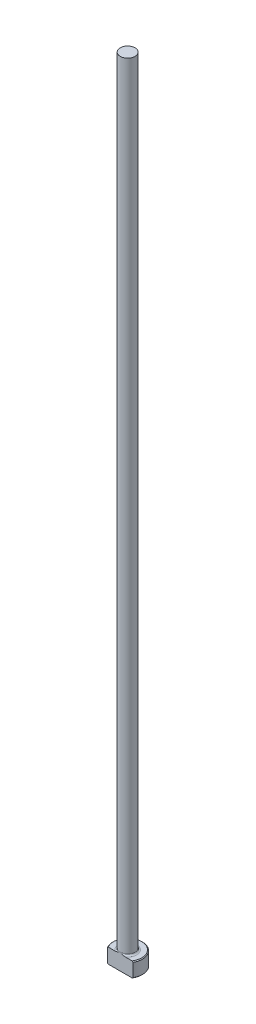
ISO-10303-21;
HEADER;
FILE_DESCRIPTION(('STEP AP214'),'2;1');
FILE_NAME('part.step','',(''),(''),'','','');
FILE_SCHEMA(('AUTOMOTIVE_DESIGN { 1 0 10303 214 1 1 1 1 }'));
ENDSEC;
DATA;
#1=APPLICATION_CONTEXT('core data for automotive mechanical design processes');
#2=APPLICATION_PROTOCOL_DEFINITION('international standard','automotive_design',2000,#1);
#3=PRODUCT_CONTEXT('',#1,'mechanical');
#4=PRODUCT('Part','Part','',(#3));
#5=PRODUCT_RELATED_PRODUCT_CATEGORY('part','',(#4));
#6=PRODUCT_DEFINITION_FORMATION('','',#4);
#7=PRODUCT_DEFINITION_CONTEXT('part definition',#1,'design');
#8=PRODUCT_DEFINITION('design','',#6,#7);
#9=PRODUCT_DEFINITION_SHAPE('','',#8);
#10=(LENGTH_UNIT() NAMED_UNIT(*) SI_UNIT(.MILLI.,.METRE.));
#11=(NAMED_UNIT(*) PLANE_ANGLE_UNIT() SI_UNIT($,.RADIAN.));
#12=(NAMED_UNIT(*) SI_UNIT($,.STERADIAN.) SOLID_ANGLE_UNIT());
#13=UNCERTAINTY_MEASURE_WITH_UNIT(LENGTH_MEASURE(1.E-05),#10,'distance_accuracy_value','');
#14=(GEOMETRIC_REPRESENTATION_CONTEXT(3) GLOBAL_UNCERTAINTY_ASSIGNED_CONTEXT((#13)) GLOBAL_UNIT_ASSIGNED_CONTEXT((#10,
#11,#12)) REPRESENTATION_CONTEXT('',''));
#15=CARTESIAN_POINT('',(0.,0.,0.));
#16=DIRECTION('',(0.,0.,1.));
#17=DIRECTION('',(1.,0.,0.));
#18=AXIS2_PLACEMENT_3D('',#15,#16,#17);
#19=CARTESIAN_POINT('',(0.,0.,0.));
#20=DIRECTION('',(0.,-1.,0.));
#21=DIRECTION('',(0.,0.,-1.));
#22=AXIS2_PLACEMENT_3D('',#19,#20,#21);
#23=PLANE('',#22);
#24=CARTESIAN_POINT('',(0.,0.,0.));
#25=DIRECTION('',(0.,-1.,0.));
#26=DIRECTION('',(0.,0.,-1.));
#27=AXIS2_PLACEMENT_3D('',#24,#25,#26);
#28=CIRCLE('',#27,4.5085);
#29=CARTESIAN_POINT('',(-3.82834437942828,0.,2.38124999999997));
#30=VERTEX_POINT('',#29);
#31=CARTESIAN_POINT('',(3.82834437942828,0.,2.38124999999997));
#32=VERTEX_POINT('',#31);
#33=EDGE_CURVE('E98',#30,#32,#28,.T.);
#34=ORIENTED_EDGE('',*,*,#33,.T.);
#35=DIRECTION('',(-1.,0.,0.));
#36=VECTOR('',#35,1.);
#37=CARTESIAN_POINT('',(-4.12444598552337,0.,2.38124999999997));
#38=LINE('',#37,#36);
#39=EDGE_CURVE('E83',#32,#30,#38,.T.);
#40=ORIENTED_EDGE('',*,*,#39,.T.);
#41=EDGE_LOOP('',(#34,#40));
#42=FACE_BOUND('',#41,.T.);
#43=ADVANCED_FACE('F32',(#42),#23,.T.);
#44=CARTESIAN_POINT('',(0.,259.958771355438,0.));
#45=DIRECTION('',(0.,1.,0.));
#46=DIRECTION('',(0.,0.,1.));
#47=AXIS2_PLACEMENT_3D('',#44,#45,#46);
#48=CYLINDRICAL_SURFACE('',#47,4.76249999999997);
#49=CARTESIAN_POINT('',(0.,4.49580000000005,0.));
#50=DIRECTION('',(0.,1.,0.));
#51=DIRECTION('',(0.,0.,1.));
#52=AXIS2_PLACEMENT_3D('',#49,#50,#51);
#53=CIRCLE('',#52,4.76249999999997);
#54=CARTESIAN_POINT('',(-4.12444598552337,4.49580000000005,2.38124999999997));
#55=VERTEX_POINT('',#54);
#56=CARTESIAN_POINT('',(4.12444598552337,4.49580000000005,2.38124999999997));
#57=VERTEX_POINT('',#56);
#58=EDGE_CURVE('E104',#55,#57,#53,.F.);
#59=ORIENTED_EDGE('',*,*,#58,.T.);
#60=DIRECTION('',(0.,-1.,0.));
#61=VECTOR('',#60,1.);
#62=CARTESIAN_POINT('',(4.12444598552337,254.,2.38124999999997));
#63=LINE('',#62,#61);
#64=CARTESIAN_POINT('',(4.12444598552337,0.254000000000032,2.38124999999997));
#65=VERTEX_POINT('',#64);
#66=EDGE_CURVE('E183',#57,#65,#63,.T.);
#67=ORIENTED_EDGE('',*,*,#66,.T.);
#68=CARTESIAN_POINT('',(0.,0.254000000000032,0.));
#69=DIRECTION('',(0.,-1.,0.));
#70=DIRECTION('',(0.,0.,-1.));
#71=AXIS2_PLACEMENT_3D('',#68,#69,#70);
#72=CIRCLE('',#71,4.76249999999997);
#73=CARTESIAN_POINT('',(-4.12444598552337,0.254000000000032,2.38124999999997));
#74=VERTEX_POINT('',#73);
#75=EDGE_CURVE('E100',#65,#74,#72,.F.);
#76=ORIENTED_EDGE('',*,*,#75,.T.);
#77=DIRECTION('',(0.,-1.,0.));
#78=VECTOR('',#77,1.);
#79=CARTESIAN_POINT('',(-4.12444598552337,254.,2.38124999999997));
#80=LINE('',#79,#78);
#81=EDGE_CURVE('E93',#55,#74,#80,.T.);
#82=ORIENTED_EDGE('',*,*,#81,.F.);
#83=EDGE_LOOP('',(#59,#67,#76,#82));
#84=FACE_BOUND('',#83,.T.);
#85=ADVANCED_FACE('F158',(#84),#48,.T.);
#86=CARTESIAN_POINT('',(-4.76249999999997,4.7498,0.));
#87=DIRECTION('',(0.,1.,0.));
#88=DIRECTION('',(0.,0.,1.));
#89=AXIS2_PLACEMENT_3D('',#86,#87,#88);
#90=PLANE('',#89);
#91=CARTESIAN_POINT('',(0.,4.7498,0.));
#92=DIRECTION('',(0.,1.,0.));
#93=DIRECTION('',(0.,0.,1.));
#94=AXIS2_PLACEMENT_3D('',#91,#92,#93);
#95=CIRCLE('',#94,4.50850000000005);
#96=CARTESIAN_POINT('',(3.82834437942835,4.7498,2.38124999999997));
#97=VERTEX_POINT('',#96);
#98=CARTESIAN_POINT('',(-3.82834437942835,4.7498,2.38124999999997));
#99=VERTEX_POINT('',#98);
#100=EDGE_CURVE('E178',#97,#99,#95,.T.);
#101=ORIENTED_EDGE('',*,*,#100,.T.);
#102=DIRECTION('',(1.,0.,0.));
#103=VECTOR('',#102,1.);
#104=CARTESIAN_POINT('',(-4.76249999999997,4.7498,2.38124999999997));
#105=LINE('',#104,#103);
#106=CARTESIAN_POINT('',(-1.63628053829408,4.74979999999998,2.38124999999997));
#107=VERTEX_POINT('',#106);
#108=EDGE_CURVE('E57',#99,#107,#105,.T.);
#109=ORIENTED_EDGE('',*,*,#108,.T.);
#110=CARTESIAN_POINT('',(0.,4.7498,0.));
#111=DIRECTION('',(0.,1.,0.));
#112=DIRECTION('',(0.,0.,1.));
#113=AXIS2_PLACEMENT_3D('',#110,#111,#112);
#114=CIRCLE('',#113,2.88924999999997);
#115=CARTESIAN_POINT('',(1.63628053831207,4.74979999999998,2.38124999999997));
#116=VERTEX_POINT('',#115);
#117=EDGE_CURVE('E107',#107,#116,#114,.F.);
#118=ORIENTED_EDGE('',*,*,#117,.T.);
#119=EDGE_CURVE('E136',#116,#97,#105,.T.);
#120=ORIENTED_EDGE('',*,*,#119,.T.);
#121=EDGE_LOOP('',(#101,#109,#118,#120));
#122=FACE_BOUND('',#121,.T.);
#123=ADVANCED_FACE('F147',(#122),#90,.T.);
#124=CARTESIAN_POINT('',(0.,4.74980000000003,0.));
#125=DIRECTION('',(0.,-1.,0.));
#126=DIRECTION('',(0.,0.,-1.));
#127=AXIS2_PLACEMENT_3D('',#124,#125,#126);
#128=CONICAL_SURFACE('',#127,4.50850000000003,0.78539816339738);
#129=ORIENTED_EDGE('',*,*,#58,.F.);
#130=CARTESIAN_POINT('',(-9.07632696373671,-0.125199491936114,2.38124999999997));
#131=CARTESIAN_POINT('',(-8.87065492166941,0.0737284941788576,2.38124999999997));
#132=CARTESIAN_POINT('',(-8.66477571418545,0.272443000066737,2.38124999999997));
#133=CARTESIAN_POINT('',(-8.25247975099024,0.669318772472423,2.38124999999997));
#134=CARTESIAN_POINT('',(-8.04606298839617,0.867480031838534,2.38124999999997));
#135=CARTESIAN_POINT('',(-7.63246818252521,1.26321914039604,2.38124999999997));
#136=CARTESIAN_POINT('',(-7.42528980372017,1.46079663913,2.38124999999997));
#137=CARTESIAN_POINT('',(-7.0101055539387,1.85507820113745,2.38124999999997));
#138=CARTESIAN_POINT('',(-6.80209968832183,2.05178227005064,2.38124999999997));
#139=CARTESIAN_POINT('',(-6.38915972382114,2.44017052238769,2.38124999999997));
#140=CARTESIAN_POINT('',(-6.18424651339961,2.63187689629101,2.38124999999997));
#141=CARTESIAN_POINT('',(-5.77308768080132,3.01385494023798,2.38124999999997));
#142=CARTESIAN_POINT('',(-5.56684206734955,3.20412661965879,2.38124999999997));
#143=CARTESIAN_POINT('',(-5.15261075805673,3.58267904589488,2.38124999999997));
#144=CARTESIAN_POINT('',(-4.94462544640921,3.77096021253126,2.38124999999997));
#145=CARTESIAN_POINT('',(-4.52621156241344,4.14478322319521,2.38124999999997));
#146=CARTESIAN_POINT('',(-4.31578308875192,4.33032517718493,2.38124999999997));
#147=CARTESIAN_POINT('',(-3.9732977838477,4.62653970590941,2.38124999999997));
#148=CARTESIAN_POINT('',(-3.84233368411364,4.73847402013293,2.38124999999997));
#149=CARTESIAN_POINT('',(-3.57870193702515,4.96034984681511,2.38124999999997));
#150=CARTESIAN_POINT('',(-3.44603412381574,5.07029116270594,2.38124999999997));
#151=CARTESIAN_POINT('',(-3.17710603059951,5.28865042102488,2.38124999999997));
#152=CARTESIAN_POINT('',(-3.04082260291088,5.39703998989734,2.38124999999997));
#153=CARTESIAN_POINT('',(-2.76536114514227,5.61002101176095,2.38124999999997));
#154=CARTESIAN_POINT('',(-2.62618382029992,5.71461337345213,2.38124999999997));
#155=CARTESIAN_POINT('',(-2.34176048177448,5.91999033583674,2.38124999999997));
#156=CARTESIAN_POINT('',(-2.19645440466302,6.02069298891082,2.38124999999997));
#157=CARTESIAN_POINT('',(-1.97428865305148,6.1655597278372,2.38124999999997));
#158=CARTESIAN_POINT('',(-1.89947233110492,6.21285188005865,2.38124999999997));
#159=CARTESIAN_POINT('',(-1.74824792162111,6.30480910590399,2.38124999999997));
#160=CARTESIAN_POINT('',(-1.67184001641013,6.34947447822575,2.38124999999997));
#161=CARTESIAN_POINT('',(-1.51812148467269,6.43500027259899,2.38124999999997));
#162=CARTESIAN_POINT('',(-1.44083334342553,6.47590056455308,2.38124999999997));
#163=CARTESIAN_POINT('',(-1.28426365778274,6.55366381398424,2.38124999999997));
#164=CARTESIAN_POINT('',(-1.20498175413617,6.5905260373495,2.38124999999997));
#165=CARTESIAN_POINT('',(-0.964237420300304,6.69331660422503,2.38124999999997));
#166=CARTESIAN_POINT('',(-0.799296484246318,6.75178843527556,2.38124999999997));
#167=CARTESIAN_POINT('',(-0.552002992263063,6.81508469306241,2.38124999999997));
#168=CARTESIAN_POINT('',(-0.472679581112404,6.83187402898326,2.38124999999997));
#169=CARTESIAN_POINT('',(-0.312773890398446,6.85789021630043,2.38124999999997));
#170=CARTESIAN_POINT('',(-0.232191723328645,6.86711773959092,2.38124999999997));
#171=CARTESIAN_POINT('',(-0.0707510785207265,6.87735689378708,2.38124999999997));
#172=CARTESIAN_POINT('',(0.0101057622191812,6.87839396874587,2.38124999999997));
#173=CARTESIAN_POINT('',(0.171507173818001,6.87224447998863,2.38124999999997));
#174=CARTESIAN_POINT('',(0.252051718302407,6.86505723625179,2.38124999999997));
#175=CARTESIAN_POINT('',(0.411371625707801,6.84305688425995,2.38124999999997));
#176=CARTESIAN_POINT('',(0.490156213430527,6.82830923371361,2.38124999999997));
#177=CARTESIAN_POINT('',(0.646152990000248,6.79210808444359,2.38124999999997));
#178=CARTESIAN_POINT('',(0.723364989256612,6.77065378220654,2.38124999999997));
#179=CARTESIAN_POINT('',(0.876400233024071,6.72193837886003,2.38124999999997));
#180=CARTESIAN_POINT('',(0.952212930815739,6.69464457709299,2.38124999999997));
#181=CARTESIAN_POINT('',(1.10193128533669,6.63534625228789,2.38124999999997));
#182=CARTESIAN_POINT('',(1.17583732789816,6.60334269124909,2.38124999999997));
#183=CARTESIAN_POINT('',(1.3955424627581,6.50131937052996,2.38124999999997));
#184=CARTESIAN_POINT('',(1.53864983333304,6.42551986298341,2.38124999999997));
#185=CARTESIAN_POINT('',(1.81913956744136,6.2638890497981,2.38124999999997));
#186=CARTESIAN_POINT('',(1.95651442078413,6.17804511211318,2.38124999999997));
#187=CARTESIAN_POINT('',(2.22733973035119,5.99930873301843,2.38124999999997));
#188=CARTESIAN_POINT('',(2.36077258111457,5.90638983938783,2.38124999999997));
#189=CARTESIAN_POINT('',(2.62416712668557,5.7159349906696,2.38124999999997));
#190=CARTESIAN_POINT('',(2.75413052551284,5.61840136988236,2.38124999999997));
#191=CARTESIAN_POINT('',(3.01316313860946,5.41868784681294,2.38124999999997));
#192=CARTESIAN_POINT('',(3.14219807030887,5.31646368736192,2.38124999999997));
#193=CARTESIAN_POINT('',(3.39823529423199,5.10948276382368,2.38124999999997));
#194=CARTESIAN_POINT('',(3.52523736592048,5.0047257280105,2.38124999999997));
#195=CARTESIAN_POINT('',(3.7773350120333,4.79356196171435,2.38124999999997));
#196=CARTESIAN_POINT('',(3.90243446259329,4.68715984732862,2.38124999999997));
#197=CARTESIAN_POINT('',(4.15136801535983,4.47288413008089,2.38124999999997));
#198=CARTESIAN_POINT('',(4.27520209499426,4.36501050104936,2.38124999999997));
#199=CARTESIAN_POINT('',(4.60321413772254,4.07656359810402,2.38124999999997));
#200=CARTESIAN_POINT('',(4.80650119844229,3.89497797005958,2.38124999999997));
#201=CARTESIAN_POINT('',(5.21107441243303,3.52958761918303,2.38124999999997));
#202=CARTESIAN_POINT('',(5.41236050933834,3.34578283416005,2.38124999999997));
#203=CARTESIAN_POINT('',(5.81363012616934,2.97638105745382,2.38124999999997));
#204=CARTESIAN_POINT('',(6.01361224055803,2.79078254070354,2.38124999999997));
#205=CARTESIAN_POINT('',(6.41244027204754,2.41836889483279,2.38124999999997));
#206=CARTESIAN_POINT('',(6.61128618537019,2.23155376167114,2.38124999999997));
#207=CARTESIAN_POINT('',(6.99993042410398,1.86469200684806,2.38124999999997));
#208=CARTESIAN_POINT('',(7.18976440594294,1.68468313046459,2.38124999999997));
#209=CARTESIAN_POINT('',(7.56878170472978,1.32398052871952,2.38124999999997));
#210=CARTESIAN_POINT('',(7.75796501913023,1.14328680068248,2.38124999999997));
#211=CARTESIAN_POINT('',(8.1355930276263,0.781550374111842,2.38124999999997));
#212=CARTESIAN_POINT('',(8.32403831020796,0.60050828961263,2.38124999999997));
#213=CARTESIAN_POINT('',(8.70048952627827,0.237970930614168,2.38124999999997));
#214=CARTESIAN_POINT('',(8.88849546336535,0.0564756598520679,2.38124999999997));
#215=CARTESIAN_POINT('',(9.0763269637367,-0.125199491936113,2.38124999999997));
#216=B_SPLINE_CURVE_WITH_KNOTS('',3,(#130,#131,#132,#133,#134,#135,#136,#137,#138,#139,#140,
#141,#142,#143,#144,#145,#146,#147,#148,#149,#150,#151,#152,#153,#154,#155,#156,#157,#158,#159,
#160,#161,#162,#163,#164,#165,#166,#167,#168,#169,#170,#171,#172,#173,#174,#175,#176,#177,#178,
#179,#180,#181,#182,#183,#184,#185,#186,#187,#188,#189,#190,#191,#192,#193,#194,#195,#196,#197,
#198,#199,#200,#201,#202,#203,#204,#205,#206,#207,#208,#209,#210,#211,#212,#213,#214,#215),
.UNSPECIFIED.,.F.,.F.,(4,2,2,2,2,2,2,2,2,2,2,2,2,2,2,2,2,2,2,2,2,2,2,2,2,2,2,2,2,2,2,2,2,2,2,2,
2,2,2,2,2,2,4),(0.,0.858406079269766,1.71682320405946,2.57567962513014,3.43453049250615,
4.27634907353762,5.11816214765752,5.95979398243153,6.80139193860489,7.31822134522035,
7.83510145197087,8.3574434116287,8.87965953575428,9.40980621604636,9.67529378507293,
9.94075110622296,10.2029603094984,10.4652171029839,10.98772376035,11.230668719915,
11.4735920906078,11.7157605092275,11.9579489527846,12.1980750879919,12.4382300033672,
12.6797667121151,12.9212541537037,13.4063695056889,13.8921016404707,14.3797486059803,
14.8671514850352,15.3609694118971,15.854840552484,16.3475141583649,16.8401965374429,
17.6579054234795,18.4756372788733,19.2941393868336,20.112644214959,20.8974741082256,
21.6823070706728,22.4662646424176,23.2502157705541),.UNSPECIFIED.);
#217=EDGE_CURVE('E135',#55,#99,#216,.T.);
#218=ORIENTED_EDGE('',*,*,#217,.T.);
#219=ORIENTED_EDGE('',*,*,#100,.F.);
#220=EDGE_CURVE('E127',#97,#57,#216,.T.);
#221=ORIENTED_EDGE('',*,*,#220,.T.);
#222=EDGE_LOOP('',(#129,#218,#219,#221));
#223=FACE_BOUND('',#222,.T.);
#224=ADVANCED_FACE('F143',(#223),#128,.T.);
#225=CARTESIAN_POINT('',(0.,0.254000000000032,0.));
#226=DIRECTION('',(0.,1.,0.));
#227=DIRECTION('',(0.,0.,1.));
#228=AXIS2_PLACEMENT_3D('',#225,#226,#227);
#229=CONICAL_SURFACE('',#228,4.76249999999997,0.785398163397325);
#230=ORIENTED_EDGE('',*,*,#75,.F.);
#231=CARTESIAN_POINT('',(9.07632696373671,4.8749994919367,2.38124999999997));
#232=CARTESIAN_POINT('',(8.87065492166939,4.67607150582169,2.38124999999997));
#233=CARTESIAN_POINT('',(8.66477571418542,4.47735699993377,2.38124999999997));
#234=CARTESIAN_POINT('',(8.25247975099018,4.08048122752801,2.38124999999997));
#235=CARTESIAN_POINT('',(8.04606298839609,3.88231996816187,2.38124999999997));
#236=CARTESIAN_POINT('',(7.6324681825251,3.48658085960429,2.38124999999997));
#237=CARTESIAN_POINT('',(7.42528980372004,3.28900336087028,2.38124999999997));
#238=CARTESIAN_POINT('',(7.01010555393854,2.89472179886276,2.38124999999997));
#239=CARTESIAN_POINT('',(6.80209968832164,2.69801772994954,2.38124999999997));
#240=CARTESIAN_POINT('',(6.38915972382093,2.30962947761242,2.38124999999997));
#241=CARTESIAN_POINT('',(6.18424651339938,2.11792310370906,2.38124999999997));
#242=CARTESIAN_POINT('',(5.77308768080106,1.73594505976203,2.38124999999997));
#243=CARTESIAN_POINT('',(5.56684206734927,1.54567338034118,2.38124999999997));
#244=CARTESIAN_POINT('',(5.15261075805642,1.16712095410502,2.38124999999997));
#245=CARTESIAN_POINT('',(4.94462544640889,0.978839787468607,2.38124999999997));
#246=CARTESIAN_POINT('',(4.52621156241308,0.605016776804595,2.38124999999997));
#247=CARTESIAN_POINT('',(4.31578308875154,0.419474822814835,2.38124999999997));
#248=CARTESIAN_POINT('',(3.97329778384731,0.123260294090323,2.38124999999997));
#249=CARTESIAN_POINT('',(3.84233368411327,0.0113259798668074,2.38124999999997));
#250=CARTESIAN_POINT('',(3.5787019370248,-0.210549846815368,2.38124999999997));
#251=CARTESIAN_POINT('',(3.4460341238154,-0.320491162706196,2.38124999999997));
#252=CARTESIAN_POINT('',(3.17710603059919,-0.538850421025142,2.38124999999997));
#253=CARTESIAN_POINT('',(3.04082260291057,-0.647239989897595,2.38124999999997));
#254=CARTESIAN_POINT('',(2.76536114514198,-0.860221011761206,2.38124999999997));
#255=CARTESIAN_POINT('',(2.62618382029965,-0.964813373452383,2.38124999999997));
#256=CARTESIAN_POINT('',(2.34176048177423,-1.17019033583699,2.38124999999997));
#257=CARTESIAN_POINT('',(2.19645440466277,-1.27089298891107,2.38124999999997));
#258=CARTESIAN_POINT('',(1.97428865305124,-1.41575972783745,2.38124999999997));
#259=CARTESIAN_POINT('',(1.89947233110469,-1.4630518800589,2.38124999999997));
#260=CARTESIAN_POINT('',(1.74824792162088,-1.55500910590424,2.38124999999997));
#261=CARTESIAN_POINT('',(1.67184001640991,-1.59967447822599,2.38124999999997));
#262=CARTESIAN_POINT('',(1.51812148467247,-1.68520027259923,2.38124999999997));
#263=CARTESIAN_POINT('',(1.44083334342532,-1.72610056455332,2.38124999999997));
#264=CARTESIAN_POINT('',(1.28426365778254,-1.80386381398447,2.38124999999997));
#265=CARTESIAN_POINT('',(1.20498175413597,-1.84072603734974,2.38124999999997));
#266=CARTESIAN_POINT('',(0.964237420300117,-1.94351660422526,2.38124999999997));
#267=CARTESIAN_POINT('',(0.799296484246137,-2.00198843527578,2.38124999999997));
#268=CARTESIAN_POINT('',(0.552002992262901,-2.06528469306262,2.38124999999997));
#269=CARTESIAN_POINT('',(0.472679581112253,-2.08207402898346,2.38124999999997));
#270=CARTESIAN_POINT('',(0.312773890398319,-2.10809021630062,2.38124999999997));
#271=CARTESIAN_POINT('',(0.23219172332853,-2.11731773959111,2.38124999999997));
#272=CARTESIAN_POINT('',(0.0707510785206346,-2.12755689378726,2.38124999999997));
#273=CARTESIAN_POINT('',(-0.0101057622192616,-2.12859396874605,2.38124999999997));
#274=CARTESIAN_POINT('',(-0.171507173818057,-2.12244447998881,2.38124999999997));
#275=CARTESIAN_POINT('',(-0.25205171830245,-2.11525723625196,2.38124999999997));
#276=CARTESIAN_POINT('',(-0.411371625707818,-2.09325688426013,2.38124999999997));
#277=CARTESIAN_POINT('',(-0.490156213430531,-2.07850923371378,2.38124999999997));
#278=CARTESIAN_POINT('',(-0.646152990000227,-2.04230808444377,2.38124999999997));
#279=CARTESIAN_POINT('',(-0.723364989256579,-2.02085378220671,2.38124999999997));
#280=CARTESIAN_POINT('',(-0.876400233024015,-1.97213837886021,2.38124999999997));
#281=CARTESIAN_POINT('',(-0.95221293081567,-1.94484457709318,2.38124999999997));
#282=CARTESIAN_POINT('',(-1.1019312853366,-1.88554625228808,2.38124999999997));
#283=CARTESIAN_POINT('',(-1.17583732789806,-1.85354269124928,2.38124999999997));
#284=CARTESIAN_POINT('',(-1.39554246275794,-1.75151937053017,2.38124999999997));
#285=CARTESIAN_POINT('',(-1.53864983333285,-1.67571986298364,2.38124999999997));
#286=CARTESIAN_POINT('',(-1.8191395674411,-1.51408904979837,2.38124999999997));
#287=CARTESIAN_POINT('',(-1.95651442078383,-1.42824511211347,2.38124999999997));
#288=CARTESIAN_POINT('',(-2.22733973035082,-1.24950873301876,2.38124999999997));
#289=CARTESIAN_POINT('',(-2.36077258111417,-1.15658983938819,2.38124999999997));
#290=CARTESIAN_POINT('',(-2.62416712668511,-0.966134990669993,2.38124999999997));
#291=CARTESIAN_POINT('',(-2.75413052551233,-0.868601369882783,2.38124999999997));
#292=CARTESIAN_POINT('',(-3.01316313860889,-0.668887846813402,2.38124999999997));
#293=CARTESIAN_POINT('',(-3.14219807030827,-0.566663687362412,2.38124999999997));
#294=CARTESIAN_POINT('',(-3.39823529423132,-0.359682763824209,2.38124999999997));
#295=CARTESIAN_POINT('',(-3.52523736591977,-0.254925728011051,2.38124999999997));
#296=CARTESIAN_POINT('',(-3.77733501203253,-0.043761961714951,2.38124999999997));
#297=CARTESIAN_POINT('',(-3.90243446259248,0.0626401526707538,2.38124999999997));
#298=CARTESIAN_POINT('',(-4.15136801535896,0.276915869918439,2.38124999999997));
#299=CARTESIAN_POINT('',(-4.27520209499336,0.384789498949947,2.38124999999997));
#300=CARTESIAN_POINT('',(-4.60321413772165,0.673236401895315,2.38124999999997));
#301=CARTESIAN_POINT('',(-4.80650119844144,0.854822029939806,2.38124999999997));
#302=CARTESIAN_POINT('',(-5.21107441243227,1.22021238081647,2.38124999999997));
#303=CARTESIAN_POINT('',(-5.41236050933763,1.40401716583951,2.38124999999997));
#304=CARTESIAN_POINT('',(-5.81363012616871,1.77341894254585,2.38124999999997));
#305=CARTESIAN_POINT('',(-6.01361224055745,1.95901745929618,2.38124999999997));
#306=CARTESIAN_POINT('',(-6.41244027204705,2.33143110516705,2.38124999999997));
#307=CARTESIAN_POINT('',(-6.61128618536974,2.51824623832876,2.38124999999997));
#308=CARTESIAN_POINT('',(-6.9999304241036,2.88510799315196,2.38124999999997));
#309=CARTESIAN_POINT('',(-7.1897644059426,3.06511686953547,2.38124999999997));
#310=CARTESIAN_POINT('',(-7.56878170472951,3.42581947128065,2.38124999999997));
#311=CARTESIAN_POINT('',(-7.75796501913,3.60651319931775,2.38124999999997));
#312=CARTESIAN_POINT('',(-8.13559302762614,3.96824962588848,2.38124999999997));
#313=CARTESIAN_POINT('',(-8.32403831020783,4.14929171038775,2.38124999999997));
#314=CARTESIAN_POINT('',(-8.70048952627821,4.51182906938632,2.38124999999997));
#315=CARTESIAN_POINT('',(-8.88849546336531,4.69332434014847,2.38124999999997));
#316=CARTESIAN_POINT('',(-9.07632696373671,4.8749994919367,2.38124999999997));
#317=B_SPLINE_CURVE_WITH_KNOTS('',3,(#231,#232,#233,#234,#235,#236,#237,#238,#239,#240,#241,
#242,#243,#244,#245,#246,#247,#248,#249,#250,#251,#252,#253,#254,#255,#256,#257,#258,#259,#260,
#261,#262,#263,#264,#265,#266,#267,#268,#269,#270,#271,#272,#273,#274,#275,#276,#277,#278,#279,
#280,#281,#282,#283,#284,#285,#286,#287,#288,#289,#290,#291,#292,#293,#294,#295,#296,#297,#298,
#299,#300,#301,#302,#303,#304,#305,#306,#307,#308,#309,#310,#311,#312,#313,#314,#315,#316),
.UNSPECIFIED.,.F.,.F.,(4,2,2,2,2,2,2,2,2,2,2,2,2,2,2,2,2,2,2,2,2,2,2,2,2,2,2,2,2,2,2,2,2,2,2,2,
2,2,2,2,2,2,4),(0.,0.858406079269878,1.71682320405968,2.57567962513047,3.43453049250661,
4.27634907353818,5.11816214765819,5.95979398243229,6.80139193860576,7.31822134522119,
7.83510145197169,8.35744341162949,8.87965953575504,9.4098062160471,9.67529378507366,
9.94075110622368,10.2029603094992,10.4652171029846,10.9877237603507,11.2306687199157,
11.4735920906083,11.7157605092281,11.9579489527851,12.1980750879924,12.4382300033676,
12.6797667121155,12.9212541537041,13.4063695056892,13.8921016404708,14.3797486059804,
14.8671514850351,15.3609694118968,15.8548405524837,16.3475141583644,16.8401965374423,
17.6579054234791,18.4756372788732,19.2941393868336,20.1126442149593,20.897474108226,
21.6823070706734,22.4662646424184,23.2502157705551),.UNSPECIFIED.);
#318=EDGE_CURVE('E86',#65,#32,#317,.T.);
#319=ORIENTED_EDGE('',*,*,#318,.T.);
#320=ORIENTED_EDGE('',*,*,#33,.F.);
#321=EDGE_CURVE('E89',#30,#74,#317,.T.);
#322=ORIENTED_EDGE('',*,*,#321,.T.);
#323=EDGE_LOOP('',(#230,#319,#320,#322));
#324=FACE_BOUND('',#323,.T.);
#325=ADVANCED_FACE('F97',(#324),#229,.T.);
#326=CARTESIAN_POINT('',(0.,5.25779999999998,0.));
#327=DIRECTION('',(0.,1.,0.));
#328=DIRECTION('',(0.,0.,1.));
#329=AXIS2_PLACEMENT_3D('',#326,#327,#328);
#330=TOROIDAL_SURFACE('',#329,2.88924999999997,0.508);
#331=CARTESIAN_POINT('',(0.,5.25779999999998,2.38124999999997));
#332=CARTESIAN_POINT('',(0.,5.25780082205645,2.38124999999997));
#333=CARTESIAN_POINT('',(1.4424632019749E-07,5.25780164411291,2.38124999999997));
#334=CARTESIAN_POINT('',(6.16936516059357E-07,5.25780323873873,2.38124999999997));
#335=CARTESIAN_POINT('',(9.4858632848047E-07,5.25780401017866,2.38124999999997));
#336=CARTESIAN_POINT('',(1.75082081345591E-06,5.25780554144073,2.38124999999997));
#337=CARTESIAN_POINT('',(2.22915460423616E-06,5.25780629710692,2.38124999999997));
#338=CARTESIAN_POINT('',(3.27181463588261E-06,5.25780773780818,2.38124999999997));
#339=CARTESIAN_POINT('',(3.83567673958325E-06,5.25780842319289,2.38124999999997));
#340=CARTESIAN_POINT('',(5.8221973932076E-06,5.25781066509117,2.38124999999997));
#341=CARTESIAN_POINT('',(7.35849860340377E-06,5.25781212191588,2.38124999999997));
#342=CARTESIAN_POINT('',(1.05702999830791E-05,5.25781476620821,2.38124999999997));
#343=CARTESIAN_POINT('',(1.22411085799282E-05,5.25781595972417,2.38124999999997));
#344=CARTESIAN_POINT('',(1.86111250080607E-05,5.25782030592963,2.38124999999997));
#345=CARTESIAN_POINT('',(2.34784764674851E-05,5.25782322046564,2.38124999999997));
#346=CARTESIAN_POINT('',(3.31956639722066E-05,5.25782811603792,2.38124999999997));
#347=CARTESIAN_POINT('',(3.80196289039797E-05,5.25783015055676,2.38124999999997));
#348=CARTESIAN_POINT('',(5.81326131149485E-05,5.25783854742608,2.38124999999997));
#349=CARTESIAN_POINT('',(7.34799239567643E-05,5.25784474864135,2.38124999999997));
#350=CARTESIAN_POINT('',(0.000102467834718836,5.25785494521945,2.38124999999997));
#351=CARTESIAN_POINT('',(0.000116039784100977,5.25785912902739,2.38124999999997));
#352=CARTESIAN_POINT('',(0.000212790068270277,5.2578915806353,2.38124999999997));
#353=CARTESIAN_POINT('',(0.000291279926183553,5.25793204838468,2.38124999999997));
#354=CARTESIAN_POINT('',(0.000593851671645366,5.25808218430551,2.38124999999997));
#355=CARTESIAN_POINT('',(0.000821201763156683,5.25818279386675,2.38124999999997));
#356=CARTESIAN_POINT('',(0.00169456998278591,5.25857522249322,2.38124999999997));
#357=CARTESIAN_POINT('',(0.00233722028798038,5.25887652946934,2.38124999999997));
#358=CARTESIAN_POINT('',(0.00493753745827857,5.26008964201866,2.38124999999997));
#359=CARTESIAN_POINT('',(0.00689891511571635,5.26099082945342,2.38124999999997));
#360=CARTESIAN_POINT('',(0.0508383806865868,5.28118708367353,2.38124999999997));
#361=CARTESIAN_POINT('',(0.0927708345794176,5.30061501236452,2.38124999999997));
#362=CARTESIAN_POINT('',(0.175274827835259,5.33851044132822,2.38124999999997));
#363=CARTESIAN_POINT('',(0.215842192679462,5.35698764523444,2.38124999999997));
#364=CARTESIAN_POINT('',(0.30166577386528,5.39563561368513,2.38124999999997));
#365=CARTESIAN_POINT('',(0.346940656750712,5.41576561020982,2.38124999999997));
#366=CARTESIAN_POINT('',(0.438241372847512,5.45551278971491,2.38124999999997));
#367=CARTESIAN_POINT('',(0.48427022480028,5.47512306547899,2.38124999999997));
#368=CARTESIAN_POINT('',(0.565317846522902,5.50863652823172,2.38124999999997));
#369=CARTESIAN_POINT('',(0.600248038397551,5.52275299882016,2.38124999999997));
#370=CARTESIAN_POINT('',(0.67029539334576,5.55026700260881,2.38124999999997));
#371=CARTESIAN_POINT('',(0.705411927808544,5.56366614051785,2.38124999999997));
#372=CARTESIAN_POINT('',(0.809765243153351,5.60210810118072,2.38124999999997));
#373=CARTESIAN_POINT('',(0.879437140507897,5.62599843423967,2.38124999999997));
#374=CARTESIAN_POINT('',(0.996836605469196,5.66231043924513,2.38124999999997));
#375=CARTESIAN_POINT('',(1.04419582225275,5.67591104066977,2.38124999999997));
#376=CARTESIAN_POINT('',(1.13975994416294,5.70085221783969,2.38124999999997));
#377=CARTESIAN_POINT('',(1.18796799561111,5.71218047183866,2.38124999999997));
#378=CARTESIAN_POINT('',(1.33841293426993,5.74296860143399,2.38124999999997));
#379=CARTESIAN_POINT('',(1.44177435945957,5.7576740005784,2.38124999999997));
#380=CARTESIAN_POINT('',(1.6093691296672,5.76674980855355,2.38124999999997));
#381=CARTESIAN_POINT('',(1.67328580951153,5.76678281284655,2.38124999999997));
#382=CARTESIAN_POINT('',(1.79988036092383,5.75818170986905,2.38124999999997));
#383=CARTESIAN_POINT('',(1.86256375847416,5.74965525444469,2.38124999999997));
#384=CARTESIAN_POINT('',(1.96631053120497,5.72616398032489,2.38124999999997));
#385=CARTESIAN_POINT('',(2.00801024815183,5.71404279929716,2.38124999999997));
#386=CARTESIAN_POINT('',(2.0892985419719,5.68375726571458,2.38124999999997));
#387=CARTESIAN_POINT('',(2.12888534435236,5.66558792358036,2.38124999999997));
#388=CARTESIAN_POINT('',(2.19343451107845,5.6284571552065,2.38124999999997));
#389=CARTESIAN_POINT('',(2.21936120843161,5.61118061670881,2.38124999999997));
#390=CARTESIAN_POINT('',(2.26821976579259,5.57281353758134,2.38124999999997));
#391=CARTESIAN_POINT('',(2.29115716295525,5.55173022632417,2.38124999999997));
#392=CARTESIAN_POINT('',(2.32833519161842,5.51065246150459,2.38124999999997));
#393=CARTESIAN_POINT('',(2.34338589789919,5.4913946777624,2.38124999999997));
#394=CARTESIAN_POINT('',(2.37015797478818,5.45066634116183,2.38124999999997));
#395=CARTESIAN_POINT('',(2.38188059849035,5.42919662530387,2.38124999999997));
#396=CARTESIAN_POINT('',(2.40133155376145,5.38427591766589,2.38124999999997));
#397=CARTESIAN_POINT('',(2.40902526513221,5.36080970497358,2.38124999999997));
#398=CARTESIAN_POINT('',(2.41963338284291,5.31282025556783,2.38124999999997));
#399=CARTESIAN_POINT('',(2.42255209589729,5.28829799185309,2.38124999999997));
#400=CARTESIAN_POINT('',(2.42330579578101,5.24257134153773,2.38124999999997));
#401=CARTESIAN_POINT('',(2.42178572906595,5.22137526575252,2.38124999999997));
#402=CARTESIAN_POINT('',(2.41512107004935,5.17956667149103,2.38124999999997));
#403=CARTESIAN_POINT('',(2.40997679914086,5.15895410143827,2.38124999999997));
#404=CARTESIAN_POINT('',(2.39653123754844,5.11927433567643,2.38124999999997));
#405=CARTESIAN_POINT('',(2.38829719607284,5.10018404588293,2.38124999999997));
#406=CARTESIAN_POINT('',(2.36909923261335,5.06344104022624,2.38124999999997));
#407=CARTESIAN_POINT('',(2.35813436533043,5.04578882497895,2.38124999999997));
#408=CARTESIAN_POINT('',(2.32900707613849,5.00527867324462,2.38124999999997));
#409=CARTESIAN_POINT('',(2.3097304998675,4.98322039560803,2.38124999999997));
#410=CARTESIAN_POINT('',(2.26785259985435,4.94251014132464,2.38124999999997));
#411=CARTESIAN_POINT('',(2.24524341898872,4.92386645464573,2.38124999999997));
#412=CARTESIAN_POINT('',(2.18797490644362,4.88297636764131,2.38124999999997));
#413=CARTESIAN_POINT('',(2.1521587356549,4.86235631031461,2.38124999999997));
#414=CARTESIAN_POINT('',(2.07784819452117,4.8270360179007,2.38124999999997));
#415=CARTESIAN_POINT('',(2.03935503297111,4.81233313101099,2.38124999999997));
#416=CARTESIAN_POINT('',(1.93917045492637,4.78128020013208,2.38124999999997));
#417=CARTESIAN_POINT('',(1.87638619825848,4.76848853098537,2.38124999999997));
#418=CARTESIAN_POINT('',(1.74894813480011,4.75239141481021,2.38124999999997));
#419=CARTESIAN_POINT('',(1.68428057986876,4.74921386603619,2.38124999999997));
#420=CARTESIAN_POINT('',(1.56080715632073,4.75049930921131,2.38124999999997));
#421=CARTESIAN_POINT('',(1.50198901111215,4.75431101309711,2.38124999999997));
#422=CARTESIAN_POINT('',(1.38480921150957,4.76709949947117,2.38124999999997));
#423=CARTESIAN_POINT('',(1.32644892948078,4.77608822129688,2.38124999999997));
#424=CARTESIAN_POINT('',(1.21350353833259,4.79766265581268,2.38124999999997));
#425=CARTESIAN_POINT('',(1.15887777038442,4.81004137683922,2.38124999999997));
#426=CARTESIAN_POINT('',(1.05073291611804,4.83776073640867,2.38124999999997));
#427=CARTESIAN_POINT('',(0.997209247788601,4.85308377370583,2.38124999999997));
#428=CARTESIAN_POINT('',(0.874272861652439,4.89132980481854,2.38124999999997));
#429=CARTESIAN_POINT('',(0.805134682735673,4.91512993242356,2.38124999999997));
#430=CARTESIAN_POINT('',(0.701560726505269,4.95339027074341,2.38124999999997));
#431=CARTESIAN_POINT('',(0.666697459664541,4.96672252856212,2.38124999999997));
#432=CARTESIAN_POINT('',(0.59715245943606,4.99408908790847,2.38124999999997));
#433=CARTESIAN_POINT('',(0.562471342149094,5.00812495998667,2.38124999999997));
#434=CARTESIAN_POINT('',(0.481905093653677,5.04147709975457,2.38124999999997));
#435=CARTESIAN_POINT('',(0.436107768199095,5.06100454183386,2.38124999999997));
#436=CARTESIAN_POINT('',(0.345263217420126,5.10057637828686,2.38124999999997));
#437=CARTESIAN_POINT('',(0.300213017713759,5.12061397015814,2.38124999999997));
#438=CARTESIAN_POINT('',(0.214815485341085,5.15907936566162,2.38124999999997));
#439=CARTESIAN_POINT('',(0.174449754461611,5.17746700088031,2.38124999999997));
#440=CARTESIAN_POINT('',(0.0923551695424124,5.21517676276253,2.38124999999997));
#441=CARTESIAN_POINT('',(0.0506304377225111,5.23450847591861,2.38124999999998));
#442=CARTESIAN_POINT('',(0.00689891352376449,5.25460917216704,2.38124999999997));
#443=CARTESIAN_POINT('',(0.00493753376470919,5.25551035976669,2.38124999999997));
#444=CARTESIAN_POINT('',(0.00233721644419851,5.25672347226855,2.38124999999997));
#445=CARTESIAN_POINT('',(0.00169456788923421,5.25702477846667,2.38124999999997));
#446=CARTESIAN_POINT('',(0.000821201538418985,5.25741720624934,2.38124999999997));
#447=CARTESIAN_POINT('',(0.000593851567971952,5.25751781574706,2.38124999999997));
#448=CARTESIAN_POINT('',(0.000291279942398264,5.25766795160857,2.38124999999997));
#449=CARTESIAN_POINT('',(0.000212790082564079,5.25770841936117,2.38124999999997));
#450=CARTESIAN_POINT('',(0.000116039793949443,5.25774087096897,2.38124999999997));
#451=CARTESIAN_POINT('',(0.000102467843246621,5.25774505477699,2.38124999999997));
#452=CARTESIAN_POINT('',(7.34799295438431E-05,5.25775525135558,2.38124999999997));
#453=CARTESIAN_POINT('',(5.81326171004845E-05,5.25776145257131,2.38124999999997));
#454=CARTESIAN_POINT('',(3.80196309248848E-05,5.25776984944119,2.38124999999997));
#455=CARTESIAN_POINT('',(3.31956656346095E-05,5.25777188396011,2.38124999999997));
#456=CARTESIAN_POINT('',(2.34784774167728E-05,5.2577767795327,2.38124999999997));
#457=CARTESIAN_POINT('',(1.86111256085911E-05,5.25777969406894,2.38124999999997));
#458=CARTESIAN_POINT('',(1.22411087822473E-05,5.25778404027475,2.38124999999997));
#459=CARTESIAN_POINT('',(1.05703001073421E-05,5.25778523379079,2.38124999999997));
#460=CARTESIAN_POINT('',(7.3584985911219E-06,5.25778787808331,2.38124999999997));
#461=CARTESIAN_POINT('',(5.82219732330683E-06,5.25778933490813,2.38124999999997));
#462=CARTESIAN_POINT('',(3.83567661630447E-06,5.25779157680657,2.38124999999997));
#463=CARTESIAN_POINT('',(3.27181450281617E-06,5.25779226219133,2.38124999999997));
#464=CARTESIAN_POINT('',(2.22915446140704E-06,5.25779370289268,2.38124999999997));
#465=CARTESIAN_POINT('',(1.75082067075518E-06,5.25779445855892,2.38124999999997));
#466=CARTESIAN_POINT('',(9.48586199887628E-07,5.25779598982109,2.38124999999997));
#467=CARTESIAN_POINT('',(6.16936400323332E-07,5.25779676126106,2.38124999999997));
#468=CARTESIAN_POINT('',(1.44246247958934E-07,5.25779835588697,2.38124999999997));
#469=CARTESIAN_POINT('',(0.,5.25779917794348,2.38124999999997));
#470=CARTESIAN_POINT('',(0.,5.25779999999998,2.38124999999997));
#471=B_SPLINE_CURVE_WITH_KNOTS('',3,(#331,#332,#333,#334,#335,#336,#337,#338,#339,#340,#341,
#342,#343,#344,#345,#346,#347,#348,#349,#350,#351,#352,#353,#354,#355,#356,#357,#358,#359,#360,
#361,#362,#363,#364,#365,#366,#367,#368,#369,#370,#371,#372,#373,#374,#375,#376,#377,#378,#379,
#380,#381,#382,#383,#384,#385,#386,#387,#388,#389,#390,#391,#392,#393,#394,#395,#396,#397,#398,
#399,#400,#401,#402,#403,#404,#405,#406,#407,#408,#409,#410,#411,#412,#413,#414,#415,#416,#417,
#418,#419,#420,#421,#422,#423,#424,#425,#426,#427,#428,#429,#430,#431,#432,#433,#434,#435,#436,
#437,#438,#439,#440,#441,#442,#443,#444,#445,#446,#447,#448,#449,#450,#451,#452,#453,#454,#455,
#456,#457,#458,#459,#460,#461,#462,#463,#464,#465,#466,#467,#468,#469,#470),.UNSPECIFIED.,.T.,
.F.,(4,2,2,2,2,2,2,2,2,2,2,2,2,2,2,2,2,2,2,2,2,2,2,2,2,2,2,2,2,2,2,2,2,2,2,2,2,2,2,2,2,2,2,2,2,
2,2,2,2,2,2,2,2,2,2,2,2,2,2,2,2,2,2,2,2,2,2,2,2,4),(0.,2.46370354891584E-06,4.9708882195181E-06,
7.64418220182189E-06,1.03034562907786E-05,1.66236492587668E-05,2.27785414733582E-05,
3.9736495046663E-05,5.54272294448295E-05,0.000105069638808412,0.000147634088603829,
0.000411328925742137,0.00115816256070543,0.0032862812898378,0.00976302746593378,
0.148387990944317,0.282122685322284,0.430762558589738,0.580850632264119,0.693868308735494,
0.806621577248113,1.02747193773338,1.17523360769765,1.32377605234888,1.63564503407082,
1.82698196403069,2.01594223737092,2.14586868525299,2.27590258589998,2.36907162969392,
2.4620655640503,2.53511017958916,2.60812725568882,2.68176187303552,2.75533004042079,
2.81876340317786,2.88219114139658,2.9443116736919,3.00645373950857,3.09384902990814,
3.18145376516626,3.30474645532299,3.42798382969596,3.61914317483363,3.81283460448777,
3.98938468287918,4.16634356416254,4.33427105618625,4.50122426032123,4.72047312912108,
4.83244543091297,4.94467988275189,5.09403179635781,5.24194322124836,5.37501604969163,
5.51295433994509,5.51943109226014,5.52155920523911,5.52230603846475,5.52256973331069,
5.52261229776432,5.52266194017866,5.52267763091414,5.52269458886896,5.5227007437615,
5.52270706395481,5.52270972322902,5.52271239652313,5.52271490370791,5.52271736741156),.UNSPECIFIED.);
#472=CARTESIAN_POINT('',(0.,5.25779999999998,2.38124999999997));
#473=VERTEX_POINT('',#472);
#474=EDGE_CURVE('E11',#116,#473,#471,.T.);
#475=ORIENTED_EDGE('',*,*,#474,.F.);
#476=ORIENTED_EDGE('',*,*,#117,.F.);
#477=CARTESIAN_POINT('',(0.,5.25779999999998,2.38124999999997));
#478=CARTESIAN_POINT('',(0.,5.25779917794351,2.38124999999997));
#479=CARTESIAN_POINT('',(-1.4424632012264E-07,5.25779835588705,2.38124999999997));
#480=CARTESIAN_POINT('',(-6.16936516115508E-07,5.25779676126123,2.38124999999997));
#481=CARTESIAN_POINT('',(-9.48586328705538E-07,5.2577959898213,2.38124999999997));
#482=CARTESIAN_POINT('',(-1.75082081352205E-06,5.25779445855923,2.38124999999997));
#483=CARTESIAN_POINT('',(-2.22915460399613E-06,5.25779370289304,2.38124999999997));
#484=CARTESIAN_POINT('',(-3.27181463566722E-06,5.25779226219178,2.38124999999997));
#485=CARTESIAN_POINT('',(-3.83567673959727E-06,5.25779157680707,2.38124999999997));
#486=CARTESIAN_POINT('',(-5.82219739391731E-06,5.25778933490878,2.38124999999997));
#487=CARTESIAN_POINT('',(-7.35849860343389E-06,5.25778787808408,2.38124999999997));
#488=CARTESIAN_POINT('',(-1.05702999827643E-05,5.25778523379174,2.38124999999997));
#489=CARTESIAN_POINT('',(-1.22411085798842E-05,5.25778404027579,2.38124999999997));
#490=CARTESIAN_POINT('',(-1.8611125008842E-05,5.25777969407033,2.38124999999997));
#491=CARTESIAN_POINT('',(-2.34784764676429E-05,5.25777677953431,2.38124999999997));
#492=CARTESIAN_POINT('',(-3.31956639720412E-05,5.25777188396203,2.38124999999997));
#493=CARTESIAN_POINT('',(-3.80196289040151E-05,5.2577698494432,2.38124999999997));
#494=CARTESIAN_POINT('',(-5.8132613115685E-05,5.25776145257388,2.38124999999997));
#495=CARTESIAN_POINT('',(-7.3479923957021E-05,5.25775525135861,2.38124999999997));
#496=CARTESIAN_POINT('',(-0.000102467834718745,5.25774505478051,2.38124999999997));
#497=CARTESIAN_POINT('',(-0.000116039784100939,5.25774087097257,2.38124999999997));
#498=CARTESIAN_POINT('',(-0.00021279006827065,5.25770841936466,2.38124999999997));
#499=CARTESIAN_POINT('',(-0.000291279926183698,5.25766795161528,2.38124999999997));
#500=CARTESIAN_POINT('',(-0.000593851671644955,5.25751781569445,2.38124999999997));
#501=CARTESIAN_POINT('',(-0.000821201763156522,5.25741720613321,2.38124999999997));
#502=CARTESIAN_POINT('',(-0.00169456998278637,5.25702477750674,2.38124999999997));
#503=CARTESIAN_POINT('',(-0.00233722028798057,5.25672347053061,2.38124999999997));
#504=CARTESIAN_POINT('',(-0.00493753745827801,5.2555103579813,2.38124999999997));
#505=CARTESIAN_POINT('',(-0.00689891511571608,5.25460917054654,2.38124999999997));
#506=CARTESIAN_POINT('',(-0.0508383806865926,5.23441291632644,2.38124999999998));
#507=CARTESIAN_POINT('',(-0.0927708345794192,5.21498498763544,2.38124999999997));
#508=CARTESIAN_POINT('',(-0.175274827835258,5.17708955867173,2.38124999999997));
#509=CARTESIAN_POINT('',(-0.215842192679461,5.15861235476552,2.38124999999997));
#510=CARTESIAN_POINT('',(-0.301665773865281,5.11996438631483,2.38124999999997));
#511=CARTESIAN_POINT('',(-0.346940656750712,5.09983438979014,2.38124999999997));
#512=CARTESIAN_POINT('',(-0.438241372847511,5.06008721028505,2.38124999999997));
#513=CARTESIAN_POINT('',(-0.48427022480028,5.04047693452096,2.38124999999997));
#514=CARTESIAN_POINT('',(-0.565317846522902,5.00696347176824,2.38124999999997));
#515=CARTESIAN_POINT('',(-0.600248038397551,4.9928470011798,2.38124999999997));
#516=CARTESIAN_POINT('',(-0.67029539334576,4.96533299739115,2.38124999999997));
#517=CARTESIAN_POINT('',(-0.705411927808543,4.95193385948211,2.38124999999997));
#518=CARTESIAN_POINT('',(-0.809765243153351,4.91349189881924,2.38124999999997));
#519=CARTESIAN_POINT('',(-0.879437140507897,4.88960156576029,2.38124999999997));
#520=CARTESIAN_POINT('',(-0.996836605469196,4.85328956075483,2.38124999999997));
#521=CARTESIAN_POINT('',(-1.04419582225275,4.83968895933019,2.38124999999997));
#522=CARTESIAN_POINT('',(-1.13975994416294,4.81474778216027,2.38124999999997));
#523=CARTESIAN_POINT('',(-1.18796799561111,4.8034195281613,2.38124999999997));
#524=CARTESIAN_POINT('',(-1.33841293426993,4.77263139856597,2.38124999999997));
#525=CARTESIAN_POINT('',(-1.44177435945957,4.75792599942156,2.38124999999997));
#526=CARTESIAN_POINT('',(-1.6093691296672,4.74885019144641,2.38124999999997));
#527=CARTESIAN_POINT('',(-1.67328580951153,4.74881718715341,2.38124999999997));
#528=CARTESIAN_POINT('',(-1.79988036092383,4.7574182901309,2.38124999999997));
#529=CARTESIAN_POINT('',(-1.86256375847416,4.76594474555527,2.38124999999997));
#530=CARTESIAN_POINT('',(-1.96631053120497,4.78943601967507,2.38124999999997));
#531=CARTESIAN_POINT('',(-2.00801024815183,4.8015572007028,2.38124999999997));
#532=CARTESIAN_POINT('',(-2.0892985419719,4.83184273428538,2.38124999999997));
#533=CARTESIAN_POINT('',(-2.12888534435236,4.85001207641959,2.38124999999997));
#534=CARTESIAN_POINT('',(-2.19343451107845,4.88714284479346,2.38124999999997));
#535=CARTESIAN_POINT('',(-2.21936120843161,4.90441938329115,2.38124999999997));
#536=CARTESIAN_POINT('',(-2.26821976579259,4.94278646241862,2.38124999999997));
#537=CARTESIAN_POINT('',(-2.29115716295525,4.96386977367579,2.38124999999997));
#538=CARTESIAN_POINT('',(-2.32833519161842,5.00494753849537,2.38124999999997));
#539=CARTESIAN_POINT('',(-2.34338589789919,5.02420532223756,2.38124999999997));
#540=CARTESIAN_POINT('',(-2.37015797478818,5.06493365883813,2.38124999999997));
#541=CARTESIAN_POINT('',(-2.38188059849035,5.08640337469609,2.38124999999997));
#542=CARTESIAN_POINT('',(-2.40133155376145,5.13132408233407,2.38124999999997));
#543=CARTESIAN_POINT('',(-2.40902526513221,5.15479029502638,2.38124999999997));
#544=CARTESIAN_POINT('',(-2.41963338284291,5.20277974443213,2.38124999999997));
#545=CARTESIAN_POINT('',(-2.42255209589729,5.22730200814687,2.38124999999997));
#546=CARTESIAN_POINT('',(-2.42330579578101,5.27302865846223,2.38124999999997));
#547=CARTESIAN_POINT('',(-2.42178572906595,5.29422473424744,2.38124999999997));
#548=CARTESIAN_POINT('',(-2.41512107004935,5.33603332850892,2.38124999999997));
#549=CARTESIAN_POINT('',(-2.40997679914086,5.35664589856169,2.38124999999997));
#550=CARTESIAN_POINT('',(-2.39653123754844,5.39632566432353,2.38124999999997));
#551=CARTESIAN_POINT('',(-2.38829719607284,5.41541595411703,2.38124999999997));
#552=CARTESIAN_POINT('',(-2.36909923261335,5.45215895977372,2.38124999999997));
#553=CARTESIAN_POINT('',(-2.35813436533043,5.46981117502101,2.38124999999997));
#554=CARTESIAN_POINT('',(-2.32900707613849,5.51032132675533,2.38124999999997));
#555=CARTESIAN_POINT('',(-2.3097304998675,5.53237960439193,2.38124999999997));
#556=CARTESIAN_POINT('',(-2.26785259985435,5.57308985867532,2.38124999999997));
#557=CARTESIAN_POINT('',(-2.24524341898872,5.59173354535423,2.38124999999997));
#558=CARTESIAN_POINT('',(-2.18797490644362,5.63262363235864,2.38124999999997));
#559=CARTESIAN_POINT('',(-2.1521587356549,5.65324368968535,2.38124999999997));
#560=CARTESIAN_POINT('',(-2.07784819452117,5.68856398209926,2.38124999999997));
#561=CARTESIAN_POINT('',(-2.03935503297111,5.70326686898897,2.38124999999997));
#562=CARTESIAN_POINT('',(-1.93917045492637,5.73431979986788,2.38124999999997));
#563=CARTESIAN_POINT('',(-1.87638619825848,5.74711146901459,2.38124999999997));
#564=CARTESIAN_POINT('',(-1.74894813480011,5.76320858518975,2.38124999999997));
#565=CARTESIAN_POINT('',(-1.68428057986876,5.76638613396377,2.38124999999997));
#566=CARTESIAN_POINT('',(-1.56080715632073,5.76510069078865,2.38124999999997));
#567=CARTESIAN_POINT('',(-1.50198901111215,5.76128898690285,2.38124999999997));
#568=CARTESIAN_POINT('',(-1.38480921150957,5.74850050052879,2.38124999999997));
#569=CARTESIAN_POINT('',(-1.32644892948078,5.73951177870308,2.38124999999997));
#570=CARTESIAN_POINT('',(-1.21350353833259,5.71793734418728,2.38124999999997));
#571=CARTESIAN_POINT('',(-1.15887777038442,5.70555862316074,2.38124999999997));
#572=CARTESIAN_POINT('',(-1.05073291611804,5.67783926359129,2.38124999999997));
#573=CARTESIAN_POINT('',(-0.997209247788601,5.66251622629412,2.38124999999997));
#574=CARTESIAN_POINT('',(-0.874272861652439,5.62427019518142,2.38124999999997));
#575=CARTESIAN_POINT('',(-0.805134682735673,5.6004700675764,2.38124999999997));
#576=CARTESIAN_POINT('',(-0.701560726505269,5.56220972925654,2.38124999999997));
#577=CARTESIAN_POINT('',(-0.666697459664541,5.54887747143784,2.38124999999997));
#578=CARTESIAN_POINT('',(-0.59715245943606,5.52151091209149,2.38124999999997));
#579=CARTESIAN_POINT('',(-0.562471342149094,5.50747504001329,2.38124999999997));
#580=CARTESIAN_POINT('',(-0.481905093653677,5.47412290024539,2.38124999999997));
#581=CARTESIAN_POINT('',(-0.436107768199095,5.45459545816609,2.38124999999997));
#582=CARTESIAN_POINT('',(-0.345263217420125,5.4150236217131,2.38124999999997));
#583=CARTESIAN_POINT('',(-0.300213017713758,5.39498602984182,2.38124999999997));
#584=CARTESIAN_POINT('',(-0.214815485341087,5.35652063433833,2.38124999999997));
#585=CARTESIAN_POINT('',(-0.174449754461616,5.33813299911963,2.38124999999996));
#586=CARTESIAN_POINT('',(-0.0923551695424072,5.30042323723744,2.38124999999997));
#587=CARTESIAN_POINT('',(-0.0506304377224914,5.28109152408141,2.38124999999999));
#588=CARTESIAN_POINT('',(-0.00689891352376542,5.26099082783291,2.38124999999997));
#589=CARTESIAN_POINT('',(-0.00493753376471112,5.26008964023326,2.38124999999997));
#590=CARTESIAN_POINT('',(-0.00233721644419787,5.25887652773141,2.38124999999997));
#591=CARTESIAN_POINT('',(-0.00169456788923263,5.2585752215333,2.38124999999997));
#592=CARTESIAN_POINT('',(-0.000821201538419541,5.25818279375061,2.38124999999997));
#593=CARTESIAN_POINT('',(-0.000593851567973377,5.2580821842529,2.38124999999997));
#594=CARTESIAN_POINT('',(-0.000291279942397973,5.25793204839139,2.38124999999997));
#595=CARTESIAN_POINT('',(-0.000212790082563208,5.25789158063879,2.38124999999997));
#596=CARTESIAN_POINT('',(-0.000116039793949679,5.25785912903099,2.38124999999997));
#597=CARTESIAN_POINT('',(-0.000102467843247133,5.25785494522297,2.38124999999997));
#598=CARTESIAN_POINT('',(-7.34799295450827E-05,5.25784474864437,2.38124999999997));
#599=CARTESIAN_POINT('',(-5.81326171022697E-05,5.25783854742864,2.38124999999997));
#600=CARTESIAN_POINT('',(-3.80196309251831E-05,5.25783015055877,2.38124999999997));
#601=CARTESIAN_POINT('',(-3.31956656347E-05,5.25782811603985,2.38124999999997));
#602=CARTESIAN_POINT('',(-2.34784774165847E-05,5.25782322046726,2.38124999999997));
#603=CARTESIAN_POINT('',(-1.86111256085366E-05,5.25782030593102,2.38124999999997));
#604=CARTESIAN_POINT('',(-1.22411087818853E-05,5.2578159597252,2.38124999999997));
#605=CARTESIAN_POINT('',(-1.05703001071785E-05,5.25781476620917,2.38124999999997));
#606=CARTESIAN_POINT('',(-7.35849859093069E-06,5.25781212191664,2.38124999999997));
#607=CARTESIAN_POINT('',(-5.82219732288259E-06,5.25781066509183,2.38124999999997));
#608=CARTESIAN_POINT('',(-3.83567661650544E-06,5.25780842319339,2.38124999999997));
#609=CARTESIAN_POINT('',(-3.27181450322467E-06,5.25780773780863,2.38124999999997));
#610=CARTESIAN_POINT('',(-2.22915446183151E-06,5.25780629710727,2.38124999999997));
#611=CARTESIAN_POINT('',(-1.75082067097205E-06,5.25780554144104,2.38124999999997));
#612=CARTESIAN_POINT('',(-9.48586199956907E-07,5.25780401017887,2.38124999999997));
#613=CARTESIAN_POINT('',(-6.16936400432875E-07,5.2578032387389,2.38124999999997));
#614=CARTESIAN_POINT('',(-1.44246248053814E-07,5.25780164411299,2.38124999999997));
#615=CARTESIAN_POINT('',(0.,5.25780082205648,2.38124999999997));
#616=CARTESIAN_POINT('',(0.,5.25779999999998,2.38124999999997));
#617=B_SPLINE_CURVE_WITH_KNOTS('',3,(#477,#478,#479,#480,#481,#482,#483,#484,#485,#486,#487,
#488,#489,#490,#491,#492,#493,#494,#495,#496,#497,#498,#499,#500,#501,#502,#503,#504,#505,#506,
#507,#508,#509,#510,#511,#512,#513,#514,#515,#516,#517,#518,#519,#520,#521,#522,#523,#524,#525,
#526,#527,#528,#529,#530,#531,#532,#533,#534,#535,#536,#537,#538,#539,#540,#541,#542,#543,#544,
#545,#546,#547,#548,#549,#550,#551,#552,#553,#554,#555,#556,#557,#558,#559,#560,#561,#562,#563,
#564,#565,#566,#567,#568,#569,#570,#571,#572,#573,#574,#575,#576,#577,#578,#579,#580,#581,#582,
#583,#584,#585,#586,#587,#588,#589,#590,#591,#592,#593,#594,#595,#596,#597,#598,#599,#600,#601,
#602,#603,#604,#605,#606,#607,#608,#609,#610,#611,#612,#613,#614,#615,#616),.UNSPECIFIED.,.T.,
.F.,(4,2,2,2,2,2,2,2,2,2,2,2,2,2,2,2,2,2,2,2,2,2,2,2,2,2,2,2,2,2,2,2,2,2,2,2,2,2,2,2,2,2,2,2,2,
2,2,2,2,2,2,2,2,2,2,2,2,2,2,2,2,2,2,2,2,2,2,2,2,4),(0.,2.46370354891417E-06,
4.97088821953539E-06,7.64418220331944E-06,1.03034562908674E-05,1.66236492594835E-05,
2.27785414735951E-05,3.97364950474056E-05,5.54272294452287E-05,0.000105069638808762,
0.000147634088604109,0.000411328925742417,0.00115816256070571,0.00328628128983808,
0.00976302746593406,0.148387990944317,0.282122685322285,0.430762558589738,0.580850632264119,
0.693868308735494,0.806621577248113,1.02747193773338,1.17523360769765,1.32377605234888,
1.63564503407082,1.82698196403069,2.01594223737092,2.14586868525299,2.27590258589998,
2.36907162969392,2.4620655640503,2.53511017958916,2.60812725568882,2.68176187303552,
2.75533004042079,2.81876340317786,2.88219114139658,2.9443116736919,3.00645373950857,
3.09384902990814,3.18145376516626,3.30474645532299,3.42798382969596,3.61914317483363,
3.81283460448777,3.98938468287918,4.16634356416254,4.33427105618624,4.50122426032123,
4.72047312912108,4.83244543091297,4.94467988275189,5.09403179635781,5.24194322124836,
5.37501604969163,5.51295433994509,5.51943109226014,5.52155920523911,5.52230603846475,
5.52256973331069,5.52261229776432,5.52266194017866,5.52267763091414,5.52269458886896,
5.5227007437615,5.52270706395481,5.52270972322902,5.52271239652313,5.52271490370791,
5.52271736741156),.UNSPECIFIED.);
#618=EDGE_CURVE('E46',#473,#107,#617,.T.);
#619=ORIENTED_EDGE('',*,*,#618,.F.);
#620=CARTESIAN_POINT('',(0.,5.25779999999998,0.));
#621=DIRECTION('',(0.,1.,0.));
#622=DIRECTION('',(0.,0.,1.));
#623=AXIS2_PLACEMENT_3D('',#620,#621,#622);
#624=CIRCLE('',#623,2.38124999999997);
#625=EDGE_CURVE('E103',#473,#473,#624,.T.);
#626=ORIENTED_EDGE('',*,*,#625,.F.);
#627=EDGE_LOOP('',(#475,#476,#619,#626));
#628=FACE_BOUND('',#627,.T.);
#629=ADVANCED_FACE('F34',(#628),#330,.F.);
#630=CARTESIAN_POINT('',(0.,259.958771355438,0.));
#631=DIRECTION('',(0.,1.,0.));
#632=DIRECTION('',(0.,0.,1.));
#633=AXIS2_PLACEMENT_3D('',#630,#631,#632);
#634=CYLINDRICAL_SURFACE('',#633,2.38124999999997);
#635=ORIENTED_EDGE('',*,*,#625,.T.);
#636=EDGE_LOOP('',(#635));
#637=FACE_BOUND('',#636,.T.);
#638=CARTESIAN_POINT('',(0.,254.,0.));
#639=DIRECTION('',(0.,1.,0.));
#640=DIRECTION('',(0.,0.,1.));
#641=AXIS2_PLACEMENT_3D('',#638,#639,#640);
#642=CIRCLE('',#641,2.38124999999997);
#643=CARTESIAN_POINT('',(0.,254.,2.38124999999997));
#644=VERTEX_POINT('',#643);
#645=EDGE_CURVE('E101',#644,#644,#642,.T.);
#646=ORIENTED_EDGE('',*,*,#645,.F.);
#647=EDGE_LOOP('',(#646));
#648=FACE_BOUND('',#647,.T.);
#649=ADVANCED_FACE('F155',(#637,#648),#634,.T.);
#650=CARTESIAN_POINT('',(-2.38124999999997,254.,0.));
#651=DIRECTION('',(0.,1.,0.));
#652=DIRECTION('',(0.,0.,1.));
#653=AXIS2_PLACEMENT_3D('',#650,#651,#652);
#654=PLANE('',#653);
#655=ORIENTED_EDGE('',*,*,#645,.T.);
#656=EDGE_LOOP('',(#655));
#657=FACE_BOUND('',#656,.T.);
#658=ADVANCED_FACE('F121',(#657),#654,.T.);
#659=CARTESIAN_POINT('',(-4.12444598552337,254.,2.38124999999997));
#660=DIRECTION('',(0.,0.,1.));
#661=DIRECTION('',(1.,0.,0.));
#662=AXIS2_PLACEMENT_3D('',#659,#660,#661);
#663=PLANE('',#662);
#664=ORIENTED_EDGE('',*,*,#66,.F.);
#665=ORIENTED_EDGE('',*,*,#220,.F.);
#666=ORIENTED_EDGE('',*,*,#119,.F.);
#667=ORIENTED_EDGE('',*,*,#474,.T.);
#668=ORIENTED_EDGE('',*,*,#618,.T.);
#669=ORIENTED_EDGE('',*,*,#108,.F.);
#670=ORIENTED_EDGE('',*,*,#217,.F.);
#671=ORIENTED_EDGE('',*,*,#81,.T.);
#672=ORIENTED_EDGE('',*,*,#321,.F.);
#673=ORIENTED_EDGE('',*,*,#39,.F.);
#674=ORIENTED_EDGE('',*,*,#318,.F.);
#675=EDGE_LOOP('',(#664,#665,#666,#667,#668,#669,#670,#671,#672,#673,#674));
#676=FACE_BOUND('',#675,.T.);
#677=ADVANCED_FACE('F85',(#676),#663,.T.);
#678=CLOSED_SHELL('',(#43,#85,#123,#224,#325,#629,#649,#658,#677));
#679=MANIFOLD_SOLID_BREP('B2',#678);
#680=ADVANCED_BREP_SHAPE_REPRESENTATION('',(#18,#679),#14);
#681=SHAPE_DEFINITION_REPRESENTATION(#9,#680);
ENDSEC;
END-ISO-10303-21;
